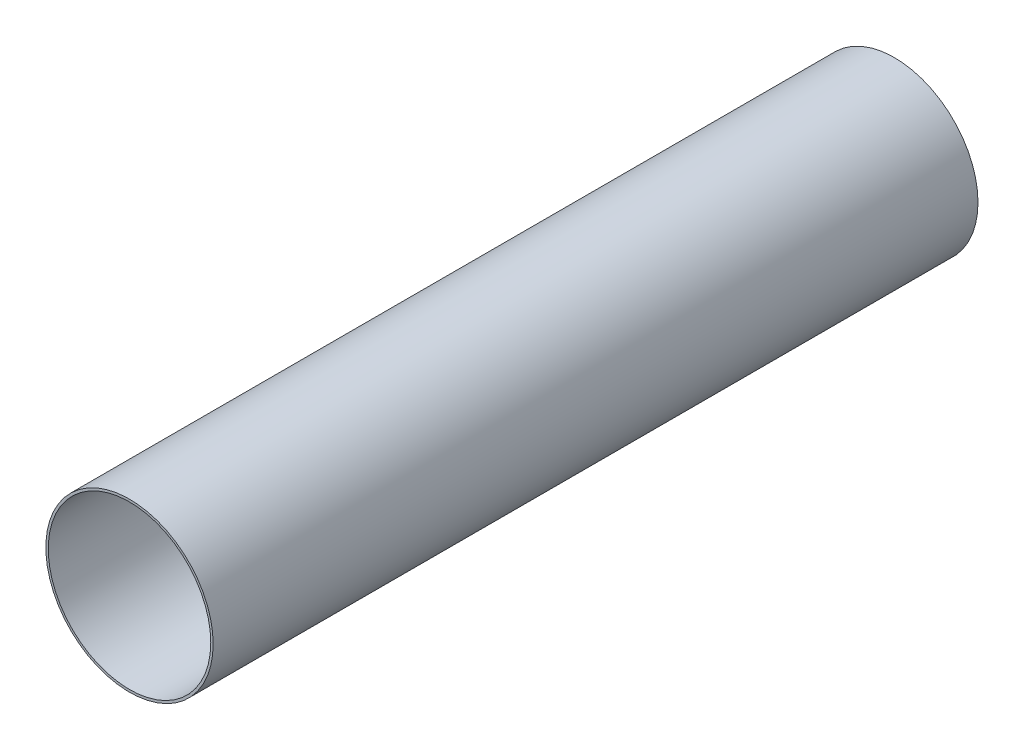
from build123d import *

# Parameters (mm, degrees)
SKETCH1_R      = 27.78125
SKETCH1_R_2    = 26.9875
EXTRUDE1_DEPTH = 254


with BuildPart() as part:
    # Sketch1 → Extrude1 (new body)
    with BuildSketch(Plane.XY):
        Circle(SKETCH1_R)
        Circle(SKETCH1_R_2, mode=Mode.SUBTRACT)
    extrude(amount=EXTRUDE1_DEPTH)


solid = part.part
